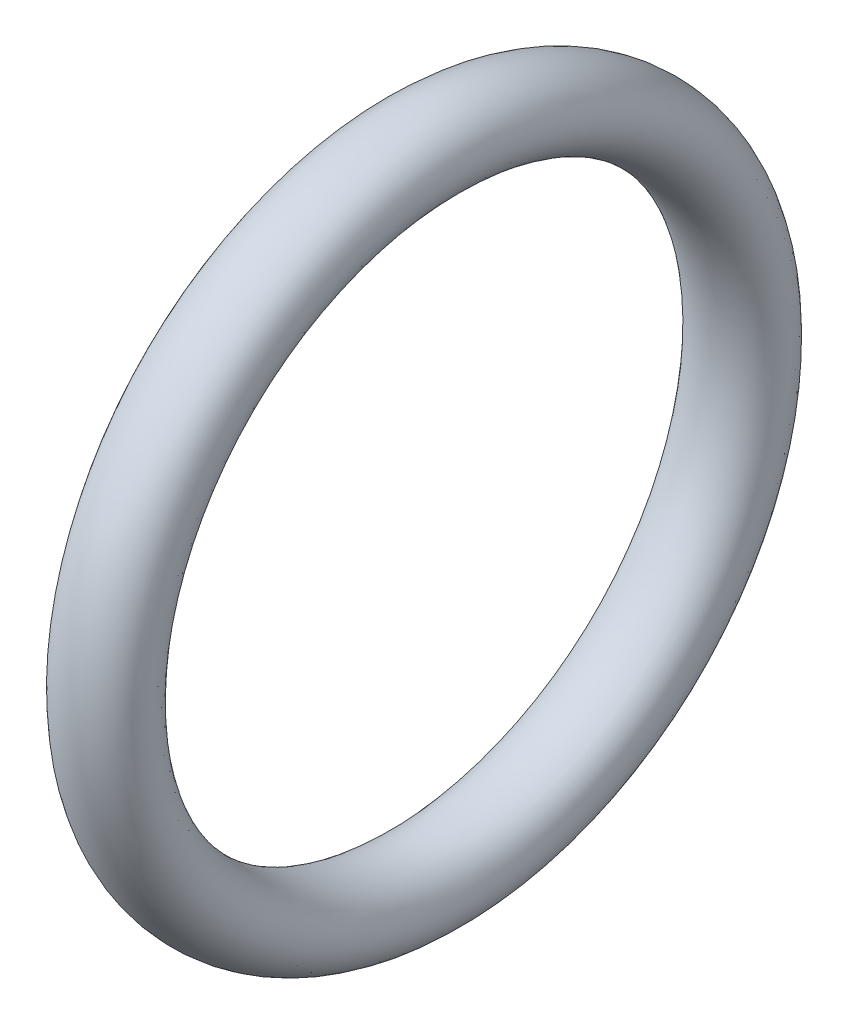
from build123d import *

# Parameters (mm, degrees)
SKETCH1_RX = 1.947434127
SKETCH1_RY = 1.6002


with BuildPart() as part:
    # Sketch1 → Revolve1 (revolve)
    with BuildSketch(Plane.XY):
        with Locations((0, 13.4874)):
            Ellipse(SKETCH1_RX, SKETCH1_RY)
    revolve(axis=Axis((-14.954242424, 0, 0), (1, 0, 0)))


solid = part.part
